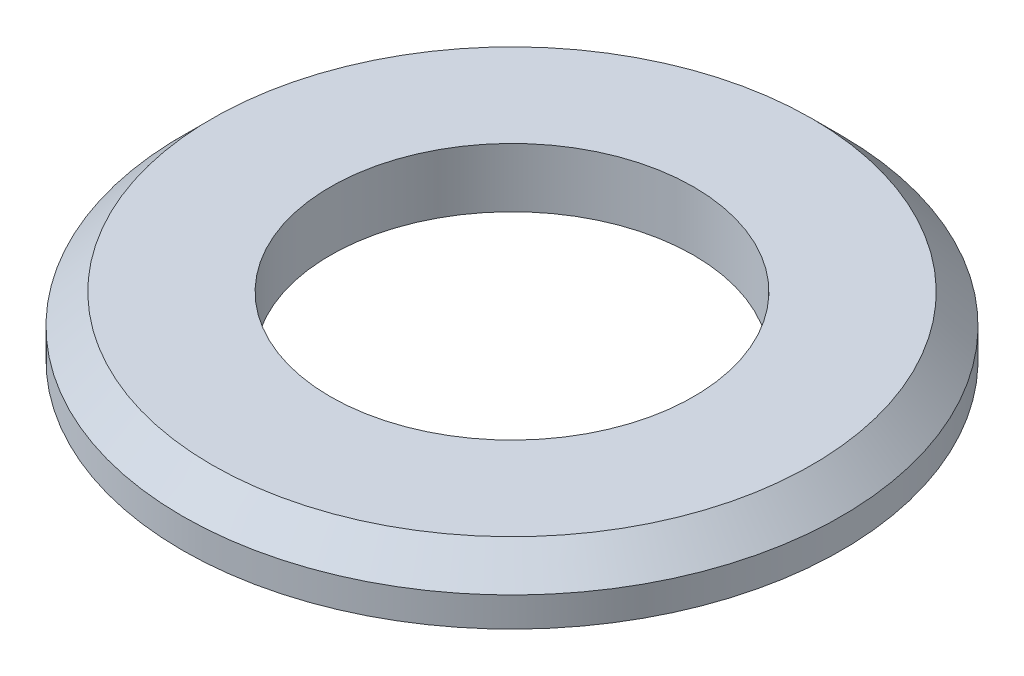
from build123d import *

# Parameters (mm, degrees)
SKETCH1_R      = 39
SKETCH1_R_2    = 21.5
EXTRUDE1_DEPTH = 7
CHAMFER1_SIZE  = 3.5


with BuildPart() as part:
    # Sketch1 → Extrude1 (new body)
    with BuildSketch(Plane(origin=(0, 0, 0), x_dir=(1, 0, 0), z_dir=(0, 1, 0))):
        with Locations(Location((0, 0, 0), (0, 0, 270))):
            Circle(SKETCH1_R)
        with Locations(Location((0, 0, 0), (0, 0, 270))):
            Circle(SKETCH1_R_2, mode=Mode.SUBTRACT)
    extrude(amount=EXTRUDE1_DEPTH)

    # Chamfer1
    chamfer1_edges = [part.edges().sort_by_distance(p)[0] for p in [
        (0, 7, -39),
    ]]
    chamfer(chamfer1_edges, length=CHAMFER1_SIZE)


solid = part.part
